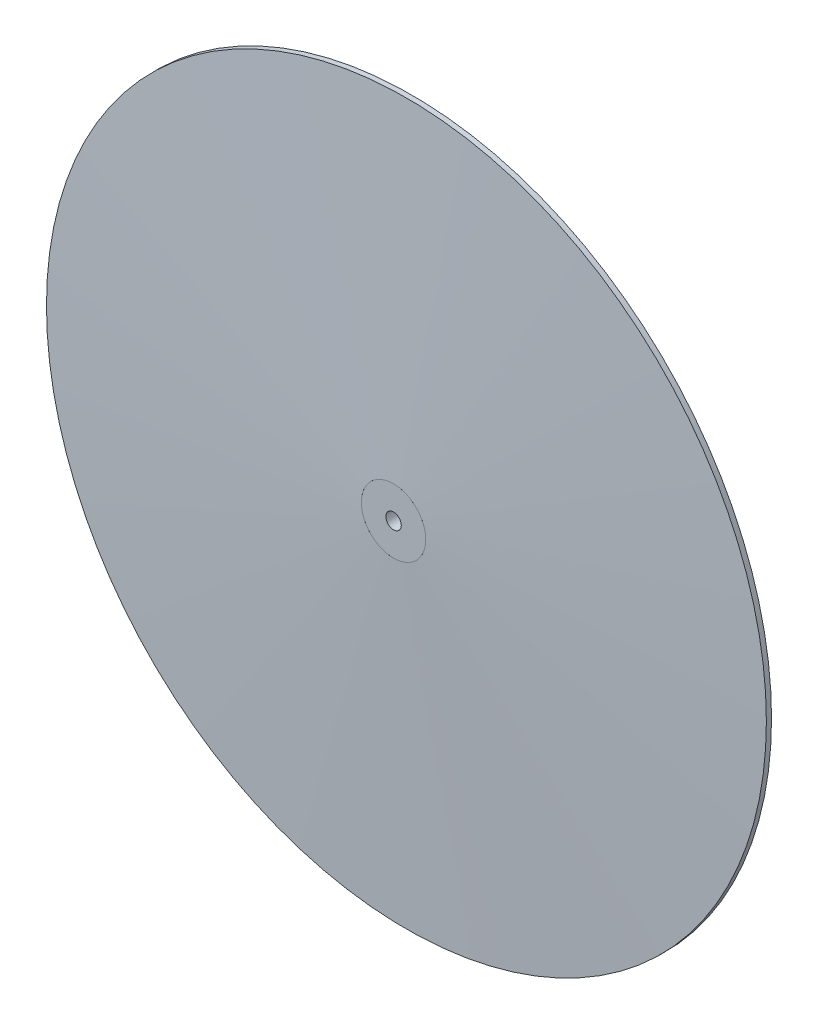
from build123d import *

# Parameters (mm, degrees)
ESQUISSE1_R        = 25
ESQUISSE1_R_2      = 6
BOSS_EXTRU_1_DEPTH = 12


with BuildPart() as part:
    # Esquisse1 → Boss.-Extru.1 (new, symmetric)
    with BuildSketch(Plane.XY):
        Circle(ESQUISSE1_R)
        Circle(ESQUISSE1_R_2, mode=Mode.SUBTRACT)
    extrude(amount=BOSS_EXTRU_1_DEPTH, both=True)


with BuildPart() as body_2:
    # Esquisse3 → R_volution1 (revolve)
    with BuildSketch(Plane(origin=(0, 0, 0), x_dir=(1, 0, 0), z_dir=(0, 1, 0))):
        Polygon((25, -12), (25, 12), (279.5, 2), (279.5, -2), align=None)
    revolve(axis=Axis((0, 0, 0), (0, 0, -1)))


solid = Compound([part.part, body_2.part])
